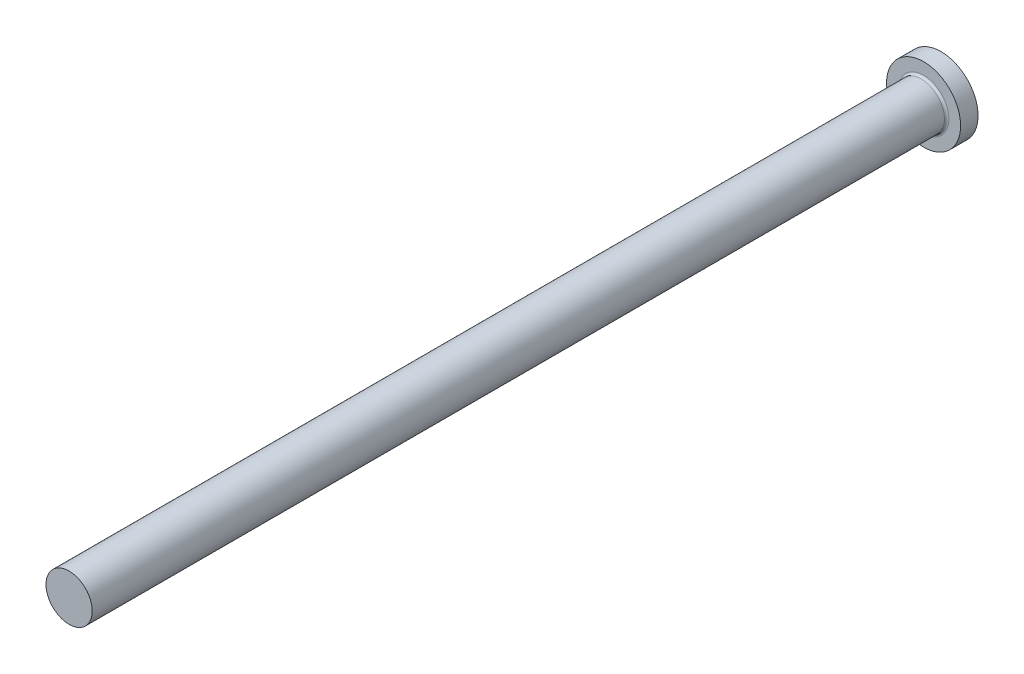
from build123d import *

# Parameters (mm, degrees)
FILLET1_R = 0.5


with BuildPart() as part:
    # FV → Revolve1 (revolve)
    with BuildSketch(Plane(origin=(0, 0, 0), x_dir=(1, 0, 0), z_dir=(0, 1, 0)), mode=Mode.PRIVATE) as revolve1_sk:
        Polygon((0, 0), (8.5, 0), (8.5, -4), (5.3, -4), (5.3, -200), (0, -200), align=None)
    revolve(revolve1_sk.sketch.rotate(Axis((0, 0, -9.033228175), (0, 0, 1)), 180), axis=Axis((0, 0, -9.033228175), (0, 0, 1)))

    # Fillet1
    fillet1_edges = [part.edges().sort_by_distance(p)[0] for p in [
        (5.3, 0, 4),
    ]]
    fillet(fillet1_edges, radius=FILLET1_R)


solid = part.part
